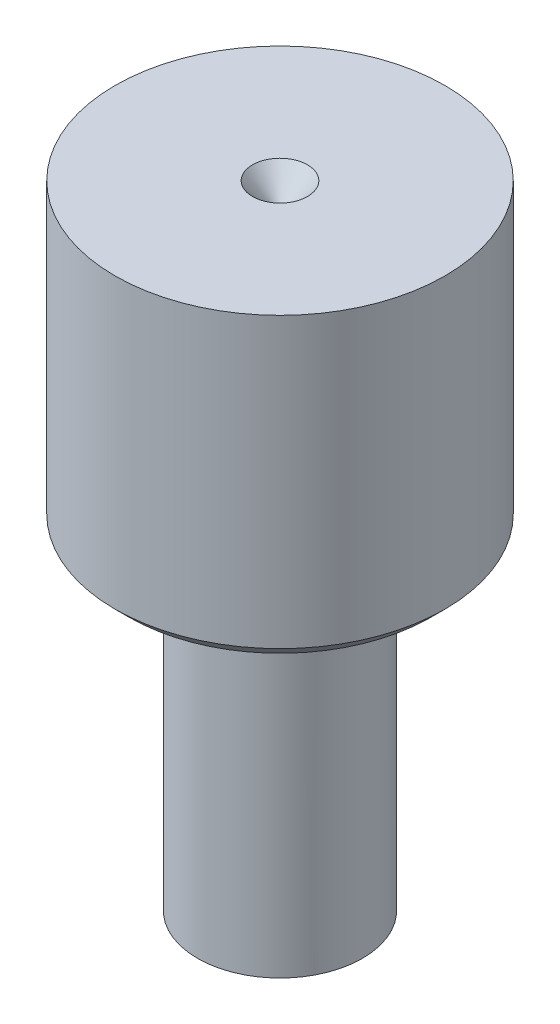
from build123d import *

# Parameters (mm, degrees)
ESQUISSE1_R             = 6
EXTRUSION1_DEPTH        = 11
ESQUISSE2_R             = 3
EXTRUSION2_DEPTH        = 12
ESQUISSE3_R             = 1
ENL_V_MAT_EXTRU_1_DEPTH = 25.515301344
ENL_V_MAT_EXTRU_1_DRAFT = -2
CHANFREIN1_SIZE         = 0.5
CONG_1_R                = 0.4


with BuildPart() as part:
    # Esquisse1 → Extrusion1 (new body)
    with BuildSketch(Plane(origin=(0, 0, 0), x_dir=(1, 0, 0), z_dir=(0, 1, 0))):
        with Locations(Location((0, 0, 0), (0, 0, 270))):
            Circle(ESQUISSE1_R)
    extrude(amount=EXTRUSION1_DEPTH)

    # Esquisse2 → Extrusion2 (add)
    with BuildSketch(Plane.XZ):
        with Locations(Location((0, 0, 0), (0, 0, 90))):
            Circle(ESQUISSE2_R)
    extrude(amount=EXTRUSION2_DEPTH)


with BuildPart() as enl_v_mat_extru_1_tool:
    # Esquisse3 → Enl_v. mat.-Extru.1 (with draft: the straight prism first)
    with BuildSketch(Plane.XZ.offset(12)):
        Circle(ESQUISSE3_R)
    extrude(amount=-ENL_V_MAT_EXTRU_1_DEPTH)
    # Enl_v. mat.-Extru.1: the draft: its side faces are tilted about the plane it starts from
    enl_v_mat_extru_1_sides = [enl_v_mat_extru_1_tool.faces().sort_by_distance(p)[0] for p in [
        (-1, 0.757650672, 0),
    ]]
    draft(enl_v_mat_extru_1_sides, Plane.XZ.offset(12), ENL_V_MAT_EXTRU_1_DRAFT)


with BuildPart() as part_1:
    add(part.part)

    # Enl_v. mat.-Extru.1: cut by enl_v_mat_extru_1_tool
    add(enl_v_mat_extru_1_tool.part, mode=Mode.SUBTRACT)

    # Enl_v. mat.-Extru.2 cone 1 section (on through the dimple's axis) → Enl_v. mat.-Extru.2 (revolve, cut)
    with BuildSketch(Plane(origin=(0, 11, 0), x_dir=(0, 0, 1), z_dir=(1, 0, 0))):
        Polygon((0, 0), (1, 0), (0, 1.191753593), align=None)
    revolve(axis=Axis((0, 11, 0), (0, -1, 0)), mode=Mode.SUBTRACT)

    # Chanfrein1
    chanfrein1_edges = [part_1.edges().sort_by_distance(p)[0] for p in [
        (0, 0, -6),
    ]]
    chamfer(chanfrein1_edges, length=CHANFREIN1_SIZE)

    # Cong_1
    cong_1_edges = [part_1.edges().sort_by_distance(p)[0] for p in [
        (0, 0, -3),
    ]]
    fillet(cong_1_edges, radius=CONG_1_R)


solid = part_1.part
